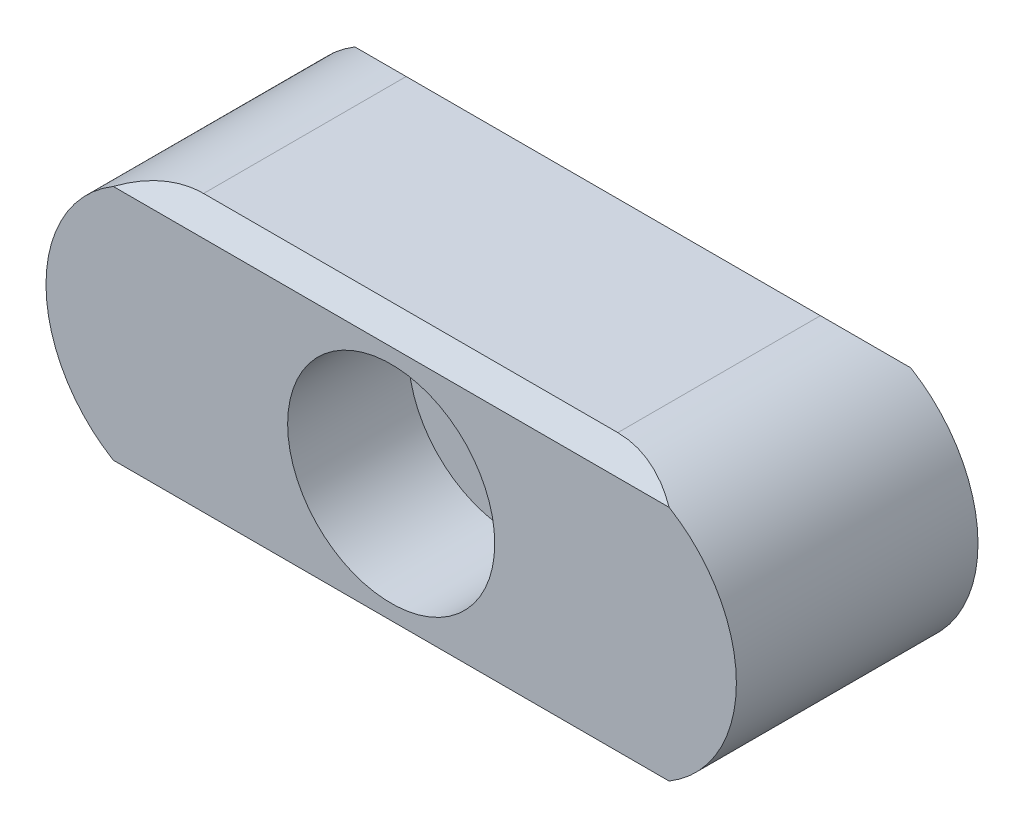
from build123d import *

# Parameters (mm, degrees)
BOSS_EXTRUDE1_DEPTH      = 3.5
BOSS_EXTRUDE1_DEPTH_BACK = 3.5
CUT_EXTRUDE1_DEPTH       = 10
CUT_EXTRUDE1_DEPTH_BACK  = 10
SKETCH2_W                = 14
SKETCH2_H                = 16


with BuildPart() as part:
    # Sketch1 → Boss-Extrude1 (new, two sides: drawn at the far end of the back side and taken through both)
    with BuildSketch(Plane.XY.offset(-BOSS_EXTRUDE1_DEPTH_BACK)):
        with BuildLine():
            Line((-6, -4), (6, -4))
            ThreePointArc((6, -4), (8.828427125, -2.828427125), (10, 0))
            ThreePointArc((10, 0), (8.828427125, 2.828427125), (6, 4))
            Line((6, 4), (-6, 4))
            ThreePointArc((-6, 4), (-8.828427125, 2.828427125), (-10, 0))
            ThreePointArc((-10, 0), (-8.828427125, -2.828427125), (-6, -4))
        make_face()
    extrude(amount=BOSS_EXTRUDE1_DEPTH + BOSS_EXTRUDE1_DEPTH_BACK)

    # Sketch2 → Cut-Extrude1 (cut, two sides: drawn at the far end of the back side and taken through both)
    with BuildSketch(Plane(origin=(0, 0, 0), x_dir=(0, 0, -1), z_dir=(1, 0, 0)).offset(-CUT_EXTRUDE1_DEPTH_BACK)):
        Rectangle(SKETCH2_W, SKETCH2_H)
        Polygon((-3.5, -3.434314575), (-2.934314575, -4), (2.934314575, -4), (3.5, -3.434314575), (3.5, 3.434314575), (2.934314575, 4), (-2.934314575, 4), (-3.5, 3.434314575), align=None, mode=Mode.SUBTRACT)
    extrude(amount=CUT_EXTRUDE1_DEPTH + CUT_EXTRUDE1_DEPTH_BACK, mode=Mode.SUBTRACT)

    # Sketch3 → Cut-Revolve1 (revolve, cut)
    with BuildSketch(Plane(origin=(0, 0, 0), x_dir=(0, 0, -1), z_dir=(1, 0, 0)), mode=Mode.PRIVATE) as cut_revolve1_sk:
        Polygon((-3.5, 0), (-3.5, 3), (0, 3), (0, 1.7), (3.5, 1.7), (3.5, 0), align=None)
    revolve(cut_revolve1_sk.sketch.rotate(Axis((0, 0, -3.5), (0, 0, 1)), 270), axis=Axis((0, 0, -3.5), (0, 0, 1)), mode=Mode.SUBTRACT)


solid = part.part
